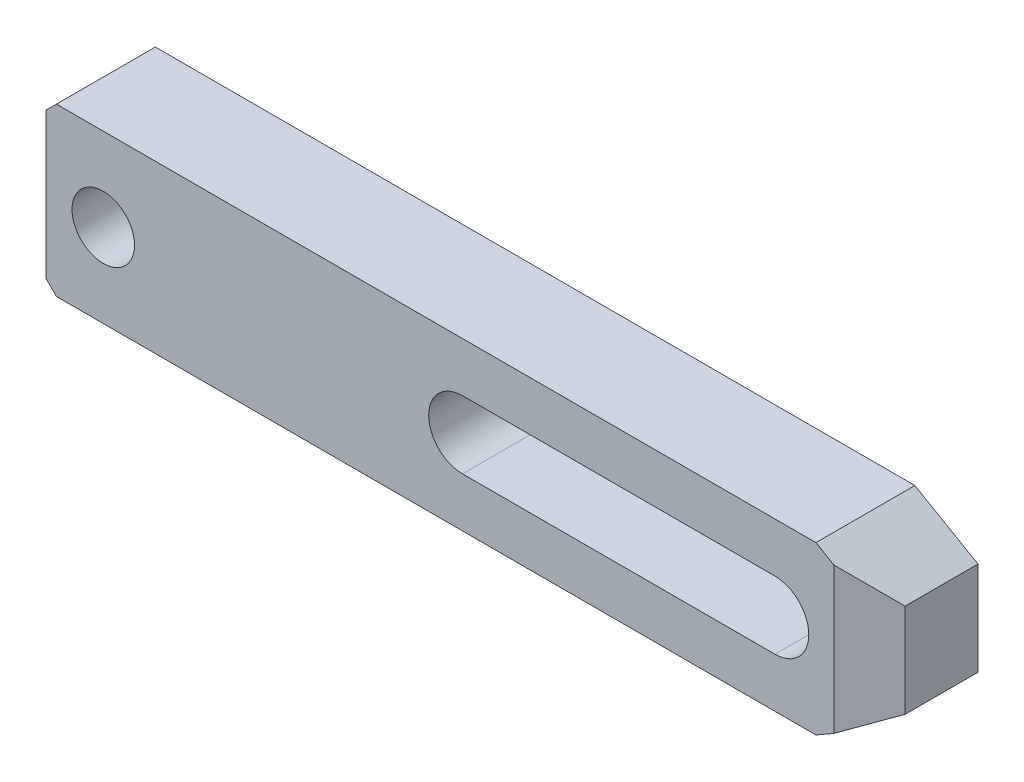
ISO-10303-21;
HEADER;
FILE_DESCRIPTION(('STEP AP214'),'2;1');
FILE_NAME('part.step','',(''),(''),'','','');
FILE_SCHEMA(('AUTOMOTIVE_DESIGN { 1 0 10303 214 1 1 1 1 }'));
ENDSEC;
DATA;
#1=APPLICATION_CONTEXT('core data for automotive mechanical design processes');
#2=APPLICATION_PROTOCOL_DEFINITION('international standard','automotive_design',2000,#1);
#3=PRODUCT_CONTEXT('',#1,'mechanical');
#4=PRODUCT('Part','Part','',(#3));
#5=PRODUCT_RELATED_PRODUCT_CATEGORY('part','',(#4));
#6=PRODUCT_DEFINITION_FORMATION('','',#4);
#7=PRODUCT_DEFINITION_CONTEXT('part definition',#1,'design');
#8=PRODUCT_DEFINITION('design','',#6,#7);
#9=PRODUCT_DEFINITION_SHAPE('','',#8);
#10=(LENGTH_UNIT() NAMED_UNIT(*) SI_UNIT(.MILLI.,.METRE.));
#11=(NAMED_UNIT(*) PLANE_ANGLE_UNIT() SI_UNIT($,.RADIAN.));
#12=(NAMED_UNIT(*) SI_UNIT($,.STERADIAN.) SOLID_ANGLE_UNIT());
#13=UNCERTAINTY_MEASURE_WITH_UNIT(LENGTH_MEASURE(1.E-05),#10,'distance_accuracy_value','');
#14=(GEOMETRIC_REPRESENTATION_CONTEXT(3) GLOBAL_UNCERTAINTY_ASSIGNED_CONTEXT((#13)) GLOBAL_UNIT_ASSIGNED_CONTEXT((#10,
#11,#12)) REPRESENTATION_CONTEXT('',''));
#15=CARTESIAN_POINT('',(0.,0.,0.));
#16=DIRECTION('',(0.,0.,1.));
#17=DIRECTION('',(1.,0.,0.));
#18=AXIS2_PLACEMENT_3D('',#15,#16,#17);
#19=CARTESIAN_POINT('',(-84.6058083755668,69.3941916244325,0.));
#20=DIRECTION('',(0.,0.,1.));
#21=DIRECTION('',(-1.,0.,0.));
#22=AXIS2_PLACEMENT_3D('',#19,#20,#21);
#23=PLANE('',#22);
#24=DIRECTION('',(0.,1.,0.));
#25=VECTOR('',#24,1.);
#26=CARTESIAN_POINT('',(-140.,-14.,0.));
#27=LINE('',#26,#25);
#28=CARTESIAN_POINT('',(-140.,-14.,0.));
#29=VERTEX_POINT('',#28);
#30=CARTESIAN_POINT('',(-140.,-6.5,0.));
#31=VERTEX_POINT('',#30);
#32=EDGE_CURVE('E147',#29,#31,#27,.T.);
#33=ORIENTED_EDGE('',*,*,#32,.T.);
#34=DIRECTION('',(-1.,0.,0.));
#35=VECTOR('',#34,1.);
#36=CARTESIAN_POINT('',(0.,-6.5,0.));
#37=LINE('',#36,#35);
#38=CARTESIAN_POINT('',(0.,-6.5,0.));
#39=VERTEX_POINT('',#38);
#40=EDGE_CURVE('E237',#39,#31,#37,.T.);
#41=ORIENTED_EDGE('',*,*,#40,.F.);
#42=CARTESIAN_POINT('',(0.,0.,0.));
#43=DIRECTION('',(0.,0.,1.));
#44=DIRECTION('',(-1.,0.,0.));
#45=AXIS2_PLACEMENT_3D('',#42,#43,#44);
#46=CIRCLE('',#45,6.5);
#47=CARTESIAN_POINT('',(0.,6.5,0.));
#48=VERTEX_POINT('',#47);
#49=EDGE_CURVE('E129',#39,#48,#46,.T.);
#50=ORIENTED_EDGE('',*,*,#49,.T.);
#51=DIRECTION('',(1.,0.,0.));
#52=VECTOR('',#51,1.);
#53=CARTESIAN_POINT('',(-60.,6.5,0.));
#54=LINE('',#53,#52);
#55=CARTESIAN_POINT('',(-140.,6.5,0.));
#56=VERTEX_POINT('',#55);
#57=EDGE_CURVE('E120',#56,#48,#54,.T.);
#58=ORIENTED_EDGE('',*,*,#57,.F.);
#59=CARTESIAN_POINT('',(-140.,14.,0.));
#60=VERTEX_POINT('',#59);
#61=EDGE_CURVE('E125',#56,#60,#27,.T.);
#62=ORIENTED_EDGE('',*,*,#61,.T.);
#63=DIRECTION('',(-0.707106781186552,-0.707106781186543,0.));
#64=VECTOR('',#63,1.);
#65=CARTESIAN_POINT('',(-138.,16.,0.));
#66=LINE('',#65,#64);
#67=CARTESIAN_POINT('',(-138.,16.,0.));
#68=VERTEX_POINT('',#67);
#69=EDGE_CURVE('E148',#68,#60,#66,.T.);
#70=ORIENTED_EDGE('',*,*,#69,.F.);
#71=DIRECTION('',(-1.,0.,0.));
#72=VECTOR('',#71,1.);
#73=CARTESIAN_POINT('',(7.87564434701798,16.,0.));
#74=LINE('',#73,#72);
#75=CARTESIAN_POINT('',(7.87564434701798,16.,0.));
#76=VERTEX_POINT('',#75);
#77=EDGE_CURVE('E151',#76,#68,#74,.T.);
#78=ORIENTED_EDGE('',*,*,#77,.F.);
#79=DIRECTION('',(-0.866025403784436,0.5,0.));
#80=VECTOR('',#79,1.);
#81=CARTESIAN_POINT('',(20.,9.,0.));
#82=LINE('',#81,#80);
#83=CARTESIAN_POINT('',(20.,9.,0.));
#84=VERTEX_POINT('',#83);
#85=EDGE_CURVE('E158',#84,#76,#82,.T.);
#86=ORIENTED_EDGE('',*,*,#85,.F.);
#87=DIRECTION('',(0.,-1.,0.));
#88=VECTOR('',#87,1.);
#89=CARTESIAN_POINT('',(20.,9.,0.));
#90=LINE('',#89,#88);
#91=CARTESIAN_POINT('',(20.,-9.,0.));
#92=VERTEX_POINT('',#91);
#93=EDGE_CURVE('E181',#84,#92,#90,.T.);
#94=ORIENTED_EDGE('',*,*,#93,.T.);
#95=DIRECTION('',(-0.86602540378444,-0.5,0.));
#96=VECTOR('',#95,1.);
#97=CARTESIAN_POINT('',(20.,-9.,0.));
#98=LINE('',#97,#96);
#99=CARTESIAN_POINT('',(7.8756443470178,-16.,0.));
#100=VERTEX_POINT('',#99);
#101=EDGE_CURVE('E208',#92,#100,#98,.T.);
#102=ORIENTED_EDGE('',*,*,#101,.T.);
#103=DIRECTION('',(-1.,0.,0.));
#104=VECTOR('',#103,1.);
#105=CARTESIAN_POINT('',(7.8756443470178,-16.,0.));
#106=LINE('',#105,#104);
#107=CARTESIAN_POINT('',(-138.,-16.,0.));
#108=VERTEX_POINT('',#107);
#109=EDGE_CURVE('E210',#100,#108,#106,.T.);
#110=ORIENTED_EDGE('',*,*,#109,.T.);
#111=DIRECTION('',(-0.707106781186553,0.707106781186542,0.));
#112=VECTOR('',#111,1.);
#113=CARTESIAN_POINT('',(-138.,-16.,0.));
#114=LINE('',#113,#112);
#115=EDGE_CURVE('E150',#108,#29,#114,.T.);
#116=ORIENTED_EDGE('',*,*,#115,.T.);
#117=EDGE_LOOP('',(#33,#41,#50,#58,#62,#70,#78,#86,#94,#102,#110,#116));
#118=FACE_BOUND('',#117,.T.);
#119=ADVANCED_FACE('F14',(#118),#23,.F.);
#120=CARTESIAN_POINT('',(-140.,-14.,19.));
#121=DIRECTION('',(-1.,0.,0.));
#122=DIRECTION('',(0.,0.,-1.));
#123=AXIS2_PLACEMENT_3D('',#120,#121,#122);
#124=PLANE('',#123);
#125=DIRECTION('',(0.,-1.,0.));
#126=VECTOR('',#125,1.);
#127=CARTESIAN_POINT('',(-140.,-14.,5.));
#128=LINE('',#127,#126);
#129=CARTESIAN_POINT('',(-140.,6.5,5.));
#130=VERTEX_POINT('',#129);
#131=CARTESIAN_POINT('',(-140.,-6.5,5.));
#132=VERTEX_POINT('',#131);
#133=EDGE_CURVE('E141',#130,#132,#128,.T.);
#134=ORIENTED_EDGE('',*,*,#133,.T.);
#135=DIRECTION('',(0.,0.,-1.));
#136=VECTOR('',#135,1.);
#137=CARTESIAN_POINT('',(-140.,-6.5,19.));
#138=LINE('',#137,#136);
#139=EDGE_CURVE('E140',#132,#31,#138,.T.);
#140=ORIENTED_EDGE('',*,*,#139,.T.);
#141=ORIENTED_EDGE('',*,*,#32,.F.);
#142=DIRECTION('',(0.,0.,-1.));
#143=VECTOR('',#142,1.);
#144=CARTESIAN_POINT('',(-140.,-14.,19.));
#145=LINE('',#144,#143);
#146=CARTESIAN_POINT('',(-140.,-14.,19.));
#147=VERTEX_POINT('',#146);
#148=EDGE_CURVE('E189',#147,#29,#145,.T.);
#149=ORIENTED_EDGE('',*,*,#148,.F.);
#150=DIRECTION('',(0.,1.,0.));
#151=VECTOR('',#150,1.);
#152=CARTESIAN_POINT('',(-140.,-14.,19.));
#153=LINE('',#152,#151);
#154=CARTESIAN_POINT('',(-140.,14.,19.));
#155=VERTEX_POINT('',#154);
#156=EDGE_CURVE('E171',#147,#155,#153,.T.);
#157=ORIENTED_EDGE('',*,*,#156,.T.);
#158=DIRECTION('',(0.,0.,-1.));
#159=VECTOR('',#158,1.);
#160=CARTESIAN_POINT('',(-140.,14.,19.));
#161=LINE('',#160,#159);
#162=EDGE_CURVE('E145',#155,#60,#161,.T.);
#163=ORIENTED_EDGE('',*,*,#162,.T.);
#164=ORIENTED_EDGE('',*,*,#61,.F.);
#165=DIRECTION('',(0.,0.,-1.));
#166=VECTOR('',#165,1.);
#167=CARTESIAN_POINT('',(-140.,6.5,19.));
#168=LINE('',#167,#166);
#169=EDGE_CURVE('E135',#130,#56,#168,.T.);
#170=ORIENTED_EDGE('',*,*,#169,.F.);
#171=EDGE_LOOP('',(#134,#140,#141,#149,#157,#163,#164,#170));
#172=FACE_BOUND('',#171,.T.);
#173=ADVANCED_FACE('F143',(#172),#124,.T.);
#174=CARTESIAN_POINT('',(-129.,0.,19.));
#175=DIRECTION('',(0.,0.,-1.));
#176=DIRECTION('',(1.,0.,0.));
#177=AXIS2_PLACEMENT_3D('',#174,#175,#176);
#178=CYLINDRICAL_SURFACE('',#177,6.);
#179=CARTESIAN_POINT('',(-129.,0.,19.));
#180=DIRECTION('',(0.,0.,1.));
#181=DIRECTION('',(-1.,0.,0.));
#182=AXIS2_PLACEMENT_3D('',#179,#180,#181);
#183=CIRCLE('',#182,6.);
#184=CARTESIAN_POINT('',(-135.,0.,19.));
#185=VERTEX_POINT('',#184);
#186=EDGE_CURVE('E161',#185,#185,#183,.T.);
#187=ORIENTED_EDGE('',*,*,#186,.T.);
#188=EDGE_LOOP('',(#187));
#189=FACE_BOUND('',#188,.T.);
#190=CARTESIAN_POINT('',(-129.,0.,5.));
#191=DIRECTION('',(0.,0.,-1.));
#192=DIRECTION('',(1.,0.,0.));
#193=AXIS2_PLACEMENT_3D('',#190,#191,#192);
#194=CIRCLE('',#193,6.);
#195=CARTESIAN_POINT('',(-123.,0.,5.));
#196=VERTEX_POINT('',#195);
#197=EDGE_CURVE('E425',#196,#196,#194,.T.);
#198=ORIENTED_EDGE('',*,*,#197,.T.);
#199=EDGE_LOOP('',(#198));
#200=FACE_BOUND('',#199,.T.);
#201=ADVANCED_FACE('F262',(#189,#200),#178,.F.);
#202=CARTESIAN_POINT('',(-60.,0.,19.));
#203=DIRECTION('',(0.,0.,-1.));
#204=DIRECTION('',(1.,0.,0.));
#205=AXIS2_PLACEMENT_3D('',#202,#203,#204);
#206=CYLINDRICAL_SURFACE('',#205,6.5);
#207=DIRECTION('',(0.,0.,-1.));
#208=VECTOR('',#207,1.);
#209=CARTESIAN_POINT('',(-60.,-6.5,19.));
#210=LINE('',#209,#208);
#211=CARTESIAN_POINT('',(-60.,-6.5,19.));
#212=VERTEX_POINT('',#211);
#213=CARTESIAN_POINT('',(-60.,-6.5,5.));
#214=VERTEX_POINT('',#213);
#215=EDGE_CURVE('E256',#212,#214,#210,.T.);
#216=ORIENTED_EDGE('',*,*,#215,.T.);
#217=CARTESIAN_POINT('',(-60.,0.,5.));
#218=DIRECTION('',(0.,0.,-1.));
#219=DIRECTION('',(1.,0.,0.));
#220=AXIS2_PLACEMENT_3D('',#217,#218,#219);
#221=CIRCLE('',#220,6.5);
#222=CARTESIAN_POINT('',(-60.,6.5,5.));
#223=VERTEX_POINT('',#222);
#224=EDGE_CURVE('E278',#214,#223,#221,.T.);
#225=ORIENTED_EDGE('',*,*,#224,.T.);
#226=DIRECTION('',(0.,0.,-1.));
#227=VECTOR('',#226,1.);
#228=CARTESIAN_POINT('',(-60.,6.5,19.));
#229=LINE('',#228,#227);
#230=CARTESIAN_POINT('',(-60.,6.5,19.));
#231=VERTEX_POINT('',#230);
#232=EDGE_CURVE('E244',#231,#223,#229,.T.);
#233=ORIENTED_EDGE('',*,*,#232,.F.);
#234=CARTESIAN_POINT('',(-60.,0.,19.));
#235=DIRECTION('',(0.,0.,1.));
#236=DIRECTION('',(-1.,0.,0.));
#237=AXIS2_PLACEMENT_3D('',#234,#235,#236);
#238=CIRCLE('',#237,6.5);
#239=EDGE_CURVE('E132',#231,#212,#238,.T.);
#240=ORIENTED_EDGE('',*,*,#239,.T.);
#241=EDGE_LOOP('',(#216,#225,#233,#240));
#242=FACE_BOUND('',#241,.T.);
#243=ADVANCED_FACE('F269',(#242),#206,.F.);
#244=CARTESIAN_POINT('',(-84.6058083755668,69.3941916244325,19.));
#245=DIRECTION('',(0.,0.,1.));
#246=DIRECTION('',(-1.,0.,0.));
#247=AXIS2_PLACEMENT_3D('',#244,#245,#246);
#248=PLANE('',#247);
#249=DIRECTION('',(0.,-1.,0.));
#250=VECTOR('',#249,1.);
#251=CARTESIAN_POINT('',(11.3397459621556,69.3941916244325,19.));
#252=LINE('',#251,#250);
#253=CARTESIAN_POINT('',(11.3397459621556,14.,19.));
#254=VERTEX_POINT('',#253);
#255=CARTESIAN_POINT('',(11.3397459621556,-14.,19.));
#256=VERTEX_POINT('',#255);
#257=EDGE_CURVE('E233',#254,#256,#252,.T.);
#258=ORIENTED_EDGE('',*,*,#257,.F.);
#259=DIRECTION('',(-0.866025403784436,0.5,0.));
#260=VECTOR('',#259,1.);
#261=CARTESIAN_POINT('',(20.,9.,19.));
#262=LINE('',#261,#260);
#263=CARTESIAN_POINT('',(7.87564434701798,16.,19.));
#264=VERTEX_POINT('',#263);
#265=EDGE_CURVE('E179',#254,#264,#262,.T.);
#266=ORIENTED_EDGE('',*,*,#265,.T.);
#267=DIRECTION('',(-1.,0.,0.));
#268=VECTOR('',#267,1.);
#269=CARTESIAN_POINT('',(7.87564434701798,16.,19.));
#270=LINE('',#269,#268);
#271=CARTESIAN_POINT('',(-138.,16.,19.));
#272=VERTEX_POINT('',#271);
#273=EDGE_CURVE('E176',#264,#272,#270,.T.);
#274=ORIENTED_EDGE('',*,*,#273,.T.);
#275=DIRECTION('',(-0.707106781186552,-0.707106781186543,0.));
#276=VECTOR('',#275,1.);
#277=CARTESIAN_POINT('',(-138.,16.,19.));
#278=LINE('',#277,#276);
#279=EDGE_CURVE('E173',#272,#155,#278,.T.);
#280=ORIENTED_EDGE('',*,*,#279,.T.);
#281=ORIENTED_EDGE('',*,*,#156,.F.);
#282=DIRECTION('',(-0.707106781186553,0.707106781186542,0.));
#283=VECTOR('',#282,1.);
#284=CARTESIAN_POINT('',(-138.,-16.,19.));
#285=LINE('',#284,#283);
#286=CARTESIAN_POINT('',(-138.,-16.,19.));
#287=VERTEX_POINT('',#286);
#288=EDGE_CURVE('E168',#287,#147,#285,.T.);
#289=ORIENTED_EDGE('',*,*,#288,.F.);
#290=DIRECTION('',(-1.,0.,0.));
#291=VECTOR('',#290,1.);
#292=CARTESIAN_POINT('',(7.8756443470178,-16.,19.));
#293=LINE('',#292,#291);
#294=CARTESIAN_POINT('',(7.8756443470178,-16.,19.));
#295=VERTEX_POINT('',#294);
#296=EDGE_CURVE('E165',#295,#287,#293,.T.);
#297=ORIENTED_EDGE('',*,*,#296,.F.);
#298=DIRECTION('',(-0.86602540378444,-0.5,0.));
#299=VECTOR('',#298,1.);
#300=CARTESIAN_POINT('',(20.,-9.,19.));
#301=LINE('',#300,#299);
#302=EDGE_CURVE('E162',#256,#295,#301,.T.);
#303=ORIENTED_EDGE('',*,*,#302,.F.);
#304=EDGE_LOOP('',(#258,#266,#274,#280,#281,#289,#297,#303));
#305=FACE_BOUND('',#304,.T.);
#306=ORIENTED_EDGE('',*,*,#186,.F.);
#307=EDGE_LOOP('',(#306));
#308=FACE_BOUND('',#307,.T.);
#309=DIRECTION('',(-1.,0.,0.));
#310=VECTOR('',#309,1.);
#311=CARTESIAN_POINT('',(0.,-6.5,19.));
#312=LINE('',#311,#310);
#313=CARTESIAN_POINT('',(0.,-6.5,19.));
#314=VERTEX_POINT('',#313);
#315=EDGE_CURVE('E247',#314,#212,#312,.T.);
#316=ORIENTED_EDGE('',*,*,#315,.T.);
#317=ORIENTED_EDGE('',*,*,#239,.F.);
#318=DIRECTION('',(1.,0.,0.));
#319=VECTOR('',#318,1.);
#320=CARTESIAN_POINT('',(-60.,6.5,19.));
#321=LINE('',#320,#319);
#322=CARTESIAN_POINT('',(0.,6.5,19.));
#323=VERTEX_POINT('',#322);
#324=EDGE_CURVE('E241',#231,#323,#321,.T.);
#325=ORIENTED_EDGE('',*,*,#324,.T.);
#326=CARTESIAN_POINT('',(0.,0.,19.));
#327=DIRECTION('',(0.,0.,1.));
#328=DIRECTION('',(-1.,0.,0.));
#329=AXIS2_PLACEMENT_3D('',#326,#327,#328);
#330=CIRCLE('',#329,6.5);
#331=EDGE_CURVE('E245',#314,#323,#330,.T.);
#332=ORIENTED_EDGE('',*,*,#331,.F.);
#333=EDGE_LOOP('',(#316,#317,#325,#332));
#334=FACE_BOUND('',#333,.T.);
#335=ADVANCED_FACE('F265',(#305,#308,#334),#248,.T.);
#336=CARTESIAN_POINT('',(20.,9.,19.));
#337=DIRECTION('',(-0.5,-0.866025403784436,0.));
#338=DIRECTION('',(0.866025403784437,-0.5,0.));
#339=AXIS2_PLACEMENT_3D('',#336,#337,#338);
#340=PLANE('',#339);
#341=ORIENTED_EDGE('',*,*,#265,.F.);
#342=DIRECTION('',(0.774596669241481,-0.447213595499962,-0.447213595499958));
#343=VECTOR('',#342,1.);
#344=CARTESIAN_POINT('',(18.2679491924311,10.,15.));
#345=LINE('',#344,#343);
#346=CARTESIAN_POINT('',(20.,9.,14.));
#347=VERTEX_POINT('',#346);
#348=EDGE_CURVE('E235',#254,#347,#345,.T.);
#349=ORIENTED_EDGE('',*,*,#348,.T.);
#350=DIRECTION('',(0.,0.,-1.));
#351=VECTOR('',#350,1.);
#352=CARTESIAN_POINT('',(20.,9.,19.));
#353=LINE('',#352,#351);
#354=EDGE_CURVE('E164',#347,#84,#353,.T.);
#355=ORIENTED_EDGE('',*,*,#354,.T.);
#356=ORIENTED_EDGE('',*,*,#85,.T.);
#357=DIRECTION('',(0.,0.,-1.));
#358=VECTOR('',#357,1.);
#359=CARTESIAN_POINT('',(7.87564434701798,16.,19.));
#360=LINE('',#359,#358);
#361=EDGE_CURVE('E9',#264,#76,#360,.T.);
#362=ORIENTED_EDGE('',*,*,#361,.F.);
#363=EDGE_LOOP('',(#341,#349,#355,#356,#362));
#364=FACE_BOUND('',#363,.T.);
#365=ADVANCED_FACE('F268',(#364),#340,.F.);
#366=CARTESIAN_POINT('',(7.87564434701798,16.,19.));
#367=DIRECTION('',(0.,-1.,0.));
#368=DIRECTION('',(0.,0.,1.));
#369=AXIS2_PLACEMENT_3D('',#366,#367,#368);
#370=PLANE('',#369);
#371=DIRECTION('',(0.,0.,-1.));
#372=VECTOR('',#371,1.);
#373=CARTESIAN_POINT('',(-138.,16.,19.));
#374=LINE('',#373,#372);
#375=EDGE_CURVE('E22',#272,#68,#374,.T.);
#376=ORIENTED_EDGE('',*,*,#375,.F.);
#377=ORIENTED_EDGE('',*,*,#273,.F.);
#378=ORIENTED_EDGE('',*,*,#361,.T.);
#379=ORIENTED_EDGE('',*,*,#77,.T.);
#380=EDGE_LOOP('',(#376,#377,#378,#379));
#381=FACE_BOUND('',#380,.T.);
#382=ADVANCED_FACE('F16',(#381),#370,.F.);
#383=CARTESIAN_POINT('',(-138.,16.,19.));
#384=DIRECTION('',(0.707106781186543,-0.707106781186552,0.));
#385=DIRECTION('',(0.707106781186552,0.707106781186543,0.));
#386=AXIS2_PLACEMENT_3D('',#383,#384,#385);
#387=PLANE('',#386);
#388=ORIENTED_EDGE('',*,*,#162,.F.);
#389=ORIENTED_EDGE('',*,*,#279,.F.);
#390=ORIENTED_EDGE('',*,*,#375,.T.);
#391=ORIENTED_EDGE('',*,*,#69,.T.);
#392=EDGE_LOOP('',(#388,#389,#390,#391));
#393=FACE_BOUND('',#392,.T.);
#394=ADVANCED_FACE('F193',(#393),#387,.F.);
#395=CARTESIAN_POINT('',(-138.,-16.,19.));
#396=DIRECTION('',(-0.707106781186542,-0.707106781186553,0.));
#397=DIRECTION('',(0.707106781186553,-0.707106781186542,0.));
#398=AXIS2_PLACEMENT_3D('',#395,#396,#397);
#399=PLANE('',#398);
#400=DIRECTION('',(0.,0.,-1.));
#401=VECTOR('',#400,1.);
#402=CARTESIAN_POINT('',(-138.,-16.,19.));
#403=LINE('',#402,#401);
#404=EDGE_CURVE('E187',#287,#108,#403,.T.);
#405=ORIENTED_EDGE('',*,*,#404,.F.);
#406=ORIENTED_EDGE('',*,*,#288,.T.);
#407=ORIENTED_EDGE('',*,*,#148,.T.);
#408=ORIENTED_EDGE('',*,*,#115,.F.);
#409=EDGE_LOOP('',(#405,#406,#407,#408));
#410=FACE_BOUND('',#409,.T.);
#411=ADVANCED_FACE('F220',(#410),#399,.T.);
#412=CARTESIAN_POINT('',(7.8756443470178,-16.,19.));
#413=DIRECTION('',(0.,-1.,0.));
#414=DIRECTION('',(0.,0.,1.));
#415=AXIS2_PLACEMENT_3D('',#412,#413,#414);
#416=PLANE('',#415);
#417=DIRECTION('',(0.,0.,-1.));
#418=VECTOR('',#417,1.);
#419=CARTESIAN_POINT('',(7.8756443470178,-16.,19.));
#420=LINE('',#419,#418);
#421=EDGE_CURVE('E185',#295,#100,#420,.T.);
#422=ORIENTED_EDGE('',*,*,#421,.F.);
#423=ORIENTED_EDGE('',*,*,#296,.T.);
#424=ORIENTED_EDGE('',*,*,#404,.T.);
#425=ORIENTED_EDGE('',*,*,#109,.F.);
#426=EDGE_LOOP('',(#422,#423,#424,#425));
#427=FACE_BOUND('',#426,.T.);
#428=ADVANCED_FACE('F306',(#427),#416,.T.);
#429=CARTESIAN_POINT('',(20.,-9.,19.));
#430=DIRECTION('',(0.5,-0.86602540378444,0.));
#431=DIRECTION('',(0.86602540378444,0.5,0.));
#432=AXIS2_PLACEMENT_3D('',#429,#430,#431);
#433=PLANE('',#432);
#434=DIRECTION('',(0.774596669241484,0.447213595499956,-0.44721359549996));
#435=VECTOR('',#434,1.);
#436=CARTESIAN_POINT('',(18.2679491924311,-10.,15.));
#437=LINE('',#436,#435);
#438=CARTESIAN_POINT('',(20.,-9.,14.));
#439=VERTEX_POINT('',#438);
#440=EDGE_CURVE('E37',#256,#439,#437,.T.);
#441=ORIENTED_EDGE('',*,*,#440,.F.);
#442=ORIENTED_EDGE('',*,*,#302,.T.);
#443=ORIENTED_EDGE('',*,*,#421,.T.);
#444=ORIENTED_EDGE('',*,*,#101,.F.);
#445=DIRECTION('',(0.,0.,-1.));
#446=VECTOR('',#445,1.);
#447=CARTESIAN_POINT('',(20.,-9.,19.));
#448=LINE('',#447,#446);
#449=EDGE_CURVE('E183',#439,#92,#448,.T.);
#450=ORIENTED_EDGE('',*,*,#449,.F.);
#451=EDGE_LOOP('',(#441,#442,#443,#444,#450));
#452=FACE_BOUND('',#451,.T.);
#453=ADVANCED_FACE('F303',(#452),#433,.T.);
#454=CARTESIAN_POINT('',(20.,9.,19.));
#455=DIRECTION('',(1.,0.,0.));
#456=DIRECTION('',(0.,0.,1.));
#457=AXIS2_PLACEMENT_3D('',#454,#455,#456);
#458=PLANE('',#457);
#459=DIRECTION('',(0.,-1.,0.));
#460=VECTOR('',#459,1.);
#461=CARTESIAN_POINT('',(20.,20.,14.));
#462=LINE('',#461,#460);
#463=EDGE_CURVE('E227',#347,#439,#462,.T.);
#464=ORIENTED_EDGE('',*,*,#463,.T.);
#465=ORIENTED_EDGE('',*,*,#449,.T.);
#466=ORIENTED_EDGE('',*,*,#93,.F.);
#467=ORIENTED_EDGE('',*,*,#354,.F.);
#468=EDGE_LOOP('',(#464,#465,#466,#467));
#469=FACE_BOUND('',#468,.T.);
#470=ADVANCED_FACE('F205',(#469),#458,.T.);
#471=CARTESIAN_POINT('',(0.,-6.5,19.));
#472=DIRECTION('',(0.,-1.,0.));
#473=DIRECTION('',(1.,0.,0.));
#474=AXIS2_PLACEMENT_3D('',#471,#472,#473);
#475=PLANE('',#474);
#476=ORIENTED_EDGE('',*,*,#40,.T.);
#477=ORIENTED_EDGE('',*,*,#139,.F.);
#478=DIRECTION('',(1.,0.,0.));
#479=VECTOR('',#478,1.);
#480=CARTESIAN_POINT('',(-150.,-6.5,5.));
#481=LINE('',#480,#479);
#482=EDGE_CURVE('E276',#132,#214,#481,.T.);
#483=ORIENTED_EDGE('',*,*,#482,.T.);
#484=ORIENTED_EDGE('',*,*,#215,.F.);
#485=ORIENTED_EDGE('',*,*,#315,.F.);
#486=DIRECTION('',(0.,0.,-1.));
#487=VECTOR('',#486,1.);
#488=CARTESIAN_POINT('',(0.,-6.5,19.));
#489=LINE('',#488,#487);
#490=EDGE_CURVE('E255',#314,#39,#489,.T.);
#491=ORIENTED_EDGE('',*,*,#490,.T.);
#492=EDGE_LOOP('',(#476,#477,#483,#484,#485,#491));
#493=FACE_BOUND('',#492,.T.);
#494=ADVANCED_FACE('F275',(#493),#475,.F.);
#495=CARTESIAN_POINT('',(0.,0.,19.));
#496=DIRECTION('',(0.,0.,-1.));
#497=DIRECTION('',(1.,0.,0.));
#498=AXIS2_PLACEMENT_3D('',#495,#496,#497);
#499=CYLINDRICAL_SURFACE('',#498,6.5);
#500=DIRECTION('',(0.,0.,-1.));
#501=VECTOR('',#500,1.);
#502=CARTESIAN_POINT('',(0.,6.5,19.));
#503=LINE('',#502,#501);
#504=EDGE_CURVE('E253',#323,#48,#503,.T.);
#505=ORIENTED_EDGE('',*,*,#504,.T.);
#506=ORIENTED_EDGE('',*,*,#49,.F.);
#507=ORIENTED_EDGE('',*,*,#490,.F.);
#508=ORIENTED_EDGE('',*,*,#331,.T.);
#509=EDGE_LOOP('',(#505,#506,#507,#508));
#510=FACE_BOUND('',#509,.T.);
#511=ADVANCED_FACE('F280',(#510),#499,.F.);
#512=CARTESIAN_POINT('',(-60.,6.5,19.));
#513=DIRECTION('',(0.,1.,0.));
#514=DIRECTION('',(-1.,0.,0.));
#515=AXIS2_PLACEMENT_3D('',#512,#513,#514);
#516=PLANE('',#515);
#517=ORIENTED_EDGE('',*,*,#57,.T.);
#518=ORIENTED_EDGE('',*,*,#504,.F.);
#519=ORIENTED_EDGE('',*,*,#324,.F.);
#520=ORIENTED_EDGE('',*,*,#232,.T.);
#521=DIRECTION('',(1.,0.,0.));
#522=VECTOR('',#521,1.);
#523=CARTESIAN_POINT('',(-150.,6.5,5.));
#524=LINE('',#523,#522);
#525=EDGE_CURVE('E29',#130,#223,#524,.T.);
#526=ORIENTED_EDGE('',*,*,#525,.F.);
#527=ORIENTED_EDGE('',*,*,#169,.T.);
#528=EDGE_LOOP('',(#517,#518,#519,#520,#526,#527));
#529=FACE_BOUND('',#528,.T.);
#530=ADVANCED_FACE('F136',(#529),#516,.F.);
#531=CARTESIAN_POINT('',(7.875644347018,20.,21.));
#532=DIRECTION('',(-0.5,0.,-0.866025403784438));
#533=DIRECTION('',(0.866025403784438,0.,-0.5));
#534=AXIS2_PLACEMENT_3D('',#531,#532,#533);
#535=PLANE('',#534);
#536=ORIENTED_EDGE('',*,*,#257,.T.);
#537=ORIENTED_EDGE('',*,*,#440,.T.);
#538=ORIENTED_EDGE('',*,*,#463,.F.);
#539=ORIENTED_EDGE('',*,*,#348,.F.);
#540=EDGE_LOOP('',(#536,#537,#538,#539));
#541=FACE_BOUND('',#540,.T.);
#542=ADVANCED_FACE('F288',(#541),#535,.F.);
#543=CARTESIAN_POINT('',(-150.,6.5,5.));
#544=DIRECTION('',(0.,0.,-1.));
#545=DIRECTION('',(1.,0.,0.));
#546=AXIS2_PLACEMENT_3D('',#543,#544,#545);
#547=PLANE('',#546);
#548=ORIENTED_EDGE('',*,*,#197,.F.);
#549=EDGE_LOOP('',(#548));
#550=FACE_BOUND('',#549,.T.);
#551=ORIENTED_EDGE('',*,*,#525,.T.);
#552=ORIENTED_EDGE('',*,*,#224,.F.);
#553=ORIENTED_EDGE('',*,*,#482,.F.);
#554=ORIENTED_EDGE('',*,*,#133,.F.);
#555=EDGE_LOOP('',(#551,#552,#553,#554));
#556=FACE_BOUND('',#555,.T.);
#557=ADVANCED_FACE('F410',(#550,#556),#547,.T.);
#558=CLOSED_SHELL('',(#119,#173,#201,#243,#335,#365,#382,#394,#411,#428,#453,#470,#494,#511,
#530,#542,#557));
#559=MANIFOLD_SOLID_BREP('B1',#558);
#560=ADVANCED_BREP_SHAPE_REPRESENTATION('',(#18,#559),#14);
#561=SHAPE_DEFINITION_REPRESENTATION(#9,#560);
ENDSEC;
END-ISO-10303-21;
